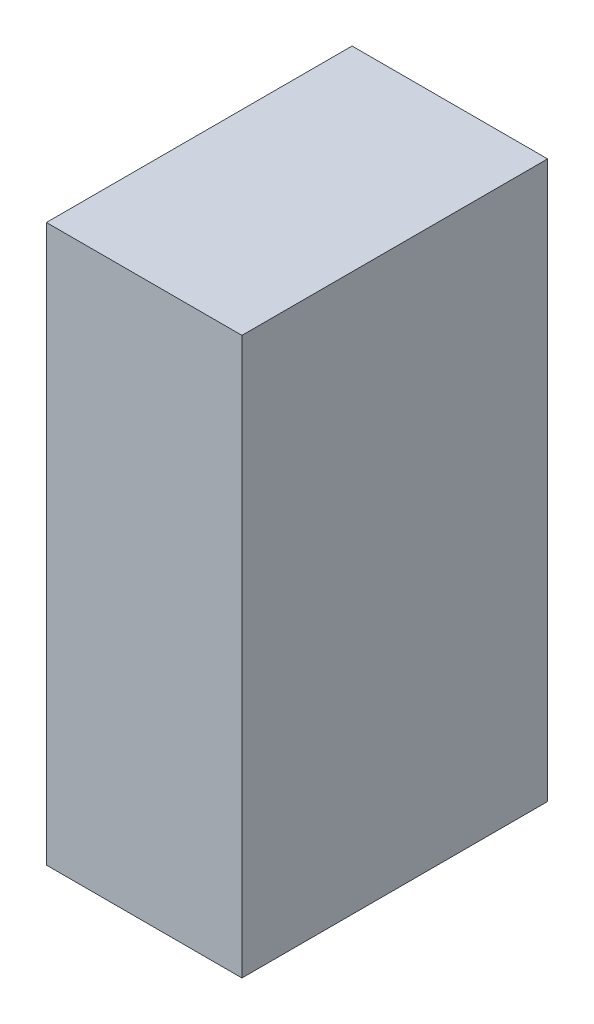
ISO-10303-21;
HEADER;
FILE_DESCRIPTION(('STEP AP214'),'2;1');
FILE_NAME('part.step','',(''),(''),'','','');
FILE_SCHEMA(('AUTOMOTIVE_DESIGN { 1 0 10303 214 1 1 1 1 }'));
ENDSEC;
DATA;
#1=APPLICATION_CONTEXT('core data for automotive mechanical design processes');
#2=APPLICATION_PROTOCOL_DEFINITION('international standard','automotive_design',2000,#1);
#3=PRODUCT_CONTEXT('',#1,'mechanical');
#4=PRODUCT('Part','Part','',(#3));
#5=PRODUCT_RELATED_PRODUCT_CATEGORY('part','',(#4));
#6=PRODUCT_DEFINITION_FORMATION('','',#4);
#7=PRODUCT_DEFINITION_CONTEXT('part definition',#1,'design');
#8=PRODUCT_DEFINITION('design','',#6,#7);
#9=PRODUCT_DEFINITION_SHAPE('','',#8);
#10=(LENGTH_UNIT() NAMED_UNIT(*) SI_UNIT(.MILLI.,.METRE.));
#11=(NAMED_UNIT(*) PLANE_ANGLE_UNIT() SI_UNIT($,.RADIAN.));
#12=(NAMED_UNIT(*) SI_UNIT($,.STERADIAN.) SOLID_ANGLE_UNIT());
#13=UNCERTAINTY_MEASURE_WITH_UNIT(LENGTH_MEASURE(1.E-05),#10,'distance_accuracy_value','');
#14=(GEOMETRIC_REPRESENTATION_CONTEXT(3) GLOBAL_UNCERTAINTY_ASSIGNED_CONTEXT((#13)) GLOBAL_UNIT_ASSIGNED_CONTEXT((#10,
#11,#12)) REPRESENTATION_CONTEXT('',''));
#15=CARTESIAN_POINT('',(0.,0.,0.));
#16=DIRECTION('',(0.,0.,1.));
#17=DIRECTION('',(1.,0.,0.));
#18=AXIS2_PLACEMENT_3D('',#15,#16,#17);
#19=CARTESIAN_POINT('',(0.32500062,0.92499942,0.));
#20=DIRECTION('',(1.,0.,0.));
#21=DIRECTION('',(0.,0.,-1.));
#22=AXIS2_PLACEMENT_3D('',#19,#20,#21);
#23=PLANE('',#22);
#24=DIRECTION('',(0.,0.,-1.));
#25=VECTOR('',#24,1.);
#26=CARTESIAN_POINT('',(0.32500062,-0.92499942,0.));
#27=LINE('',#26,#25);
#28=CARTESIAN_POINT('',(0.32500062,-0.92499942,0.));
#29=VERTEX_POINT('',#28);
#30=CARTESIAN_POINT('',(0.32500062,-0.92499942,1.016));
#31=VERTEX_POINT('',#30);
#32=EDGE_CURVE('E20',#29,#31,#27,.F.);
#33=ORIENTED_EDGE('',*,*,#32,.F.);
#34=DIRECTION('',(0.,1.,0.));
#35=VECTOR('',#34,1.);
#36=CARTESIAN_POINT('',(0.32500062,-0.92499942,0.));
#37=LINE('',#36,#35);
#38=CARTESIAN_POINT('',(0.32500062,0.92499942,0.));
#39=VERTEX_POINT('',#38);
#40=EDGE_CURVE('E79',#29,#39,#37,.T.);
#41=ORIENTED_EDGE('',*,*,#40,.T.);
#42=DIRECTION('',(0.,0.,1.));
#43=VECTOR('',#42,1.);
#44=CARTESIAN_POINT('',(0.32500062,0.92499942,0.));
#45=LINE('',#44,#43);
#46=CARTESIAN_POINT('',(0.32500062,0.92499942,1.016));
#47=VERTEX_POINT('',#46);
#48=EDGE_CURVE('E61',#47,#39,#45,.F.);
#49=ORIENTED_EDGE('',*,*,#48,.F.);
#50=DIRECTION('',(0.,1.,0.));
#51=VECTOR('',#50,1.);
#52=CARTESIAN_POINT('',(0.32500062,-0.92499942,1.016));
#53=LINE('',#52,#51);
#54=EDGE_CURVE('E56',#31,#47,#53,.T.);
#55=ORIENTED_EDGE('',*,*,#54,.F.);
#56=EDGE_LOOP('',(#33,#41,#49,#55));
#57=FACE_BOUND('',#56,.T.);
#58=ADVANCED_FACE('F17',(#57),#23,.T.);
#59=CARTESIAN_POINT('',(0.32500062,-0.92499942,0.));
#60=DIRECTION('',(0.,-1.,0.));
#61=DIRECTION('',(0.,0.,-1.));
#62=AXIS2_PLACEMENT_3D('',#59,#60,#61);
#63=PLANE('',#62);
#64=DIRECTION('',(0.,0.,1.));
#65=VECTOR('',#64,1.);
#66=CARTESIAN_POINT('',(-0.32500062,-0.92499942,0.));
#67=LINE('',#66,#65);
#68=CARTESIAN_POINT('',(-0.32500062,-0.92499942,0.));
#69=VERTEX_POINT('',#68);
#70=CARTESIAN_POINT('',(-0.32500062,-0.92499942,1.016));
#71=VERTEX_POINT('',#70);
#72=EDGE_CURVE('E83',#69,#71,#67,.T.);
#73=ORIENTED_EDGE('',*,*,#72,.F.);
#74=DIRECTION('',(1.,0.,0.));
#75=VECTOR('',#74,1.);
#76=CARTESIAN_POINT('',(0.32500062,-0.92499942,0.));
#77=LINE('',#76,#75);
#78=EDGE_CURVE('E68',#69,#29,#77,.T.);
#79=ORIENTED_EDGE('',*,*,#78,.T.);
#80=ORIENTED_EDGE('',*,*,#32,.T.);
#81=DIRECTION('',(1.,0.,0.));
#82=VECTOR('',#81,1.);
#83=CARTESIAN_POINT('',(0.32500062,-0.92499942,1.016));
#84=LINE('',#83,#82);
#85=EDGE_CURVE('E63',#71,#31,#84,.T.);
#86=ORIENTED_EDGE('',*,*,#85,.F.);
#87=EDGE_LOOP('',(#73,#79,#80,#86));
#88=FACE_BOUND('',#87,.T.);
#89=ADVANCED_FACE('F65',(#88),#63,.T.);
#90=CARTESIAN_POINT('',(0.32500062,-0.92499942,1.016));
#91=DIRECTION('',(0.,0.,1.));
#92=DIRECTION('',(1.,0.,0.));
#93=AXIS2_PLACEMENT_3D('',#90,#91,#92);
#94=PLANE('',#93);
#95=DIRECTION('',(0.,1.,0.));
#96=VECTOR('',#95,1.);
#97=CARTESIAN_POINT('',(-0.32500062,-0.92499942,1.016));
#98=LINE('',#97,#96);
#99=CARTESIAN_POINT('',(-0.32500062,0.92499942,1.016));
#100=VERTEX_POINT('',#99);
#101=EDGE_CURVE('E72',#71,#100,#98,.T.);
#102=ORIENTED_EDGE('',*,*,#101,.F.);
#103=ORIENTED_EDGE('',*,*,#85,.T.);
#104=ORIENTED_EDGE('',*,*,#54,.T.);
#105=DIRECTION('',(1.,0.,0.));
#106=VECTOR('',#105,1.);
#107=CARTESIAN_POINT('',(-0.32500062,0.92499942,1.016));
#108=LINE('',#107,#106);
#109=EDGE_CURVE('E74',#100,#47,#108,.T.);
#110=ORIENTED_EDGE('',*,*,#109,.F.);
#111=EDGE_LOOP('',(#102,#103,#104,#110));
#112=FACE_BOUND('',#111,.T.);
#113=ADVANCED_FACE('F70',(#112),#94,.T.);
#114=CARTESIAN_POINT('',(-0.32500062,0.92499942,0.));
#115=DIRECTION('',(0.,1.,0.));
#116=DIRECTION('',(0.,0.,1.));
#117=AXIS2_PLACEMENT_3D('',#114,#115,#116);
#118=PLANE('',#117);
#119=ORIENTED_EDGE('',*,*,#48,.T.);
#120=DIRECTION('',(1.,0.,0.));
#121=VECTOR('',#120,1.);
#122=CARTESIAN_POINT('',(0.32500062,0.92499942,0.));
#123=LINE('',#122,#121);
#124=CARTESIAN_POINT('',(-0.32500062,0.92499942,0.));
#125=VERTEX_POINT('',#124);
#126=EDGE_CURVE('E35',#39,#125,#123,.F.);
#127=ORIENTED_EDGE('',*,*,#126,.T.);
#128=DIRECTION('',(0.,0.,1.));
#129=VECTOR('',#128,1.);
#130=CARTESIAN_POINT('',(-0.32500062,0.92499942,0.));
#131=LINE('',#130,#129);
#132=EDGE_CURVE('E26',#100,#125,#131,.F.);
#133=ORIENTED_EDGE('',*,*,#132,.F.);
#134=ORIENTED_EDGE('',*,*,#109,.T.);
#135=EDGE_LOOP('',(#119,#127,#133,#134));
#136=FACE_BOUND('',#135,.T.);
#137=ADVANCED_FACE('F89',(#136),#118,.T.);
#138=CARTESIAN_POINT('',(0.32500062,-0.92499942,0.));
#139=DIRECTION('',(0.,0.,1.));
#140=DIRECTION('',(1.,0.,0.));
#141=AXIS2_PLACEMENT_3D('',#138,#139,#140);
#142=PLANE('',#141);
#143=DIRECTION('',(0.,1.,0.));
#144=VECTOR('',#143,1.);
#145=CARTESIAN_POINT('',(-0.32500062,-0.92499942,0.));
#146=LINE('',#145,#144);
#147=EDGE_CURVE('E11',#125,#69,#146,.F.);
#148=ORIENTED_EDGE('',*,*,#147,.F.);
#149=ORIENTED_EDGE('',*,*,#126,.F.);
#150=ORIENTED_EDGE('',*,*,#40,.F.);
#151=ORIENTED_EDGE('',*,*,#78,.F.);
#152=EDGE_LOOP('',(#148,#149,#150,#151));
#153=FACE_BOUND('',#152,.T.);
#154=ADVANCED_FACE('F91',(#153),#142,.F.);
#155=CARTESIAN_POINT('',(-0.32500062,-0.92499942,0.));
#156=DIRECTION('',(-1.,0.,0.));
#157=DIRECTION('',(0.,0.,1.));
#158=AXIS2_PLACEMENT_3D('',#155,#156,#157);
#159=PLANE('',#158);
#160=ORIENTED_EDGE('',*,*,#132,.T.);
#161=ORIENTED_EDGE('',*,*,#147,.T.);
#162=ORIENTED_EDGE('',*,*,#72,.T.);
#163=ORIENTED_EDGE('',*,*,#101,.T.);
#164=EDGE_LOOP('',(#160,#161,#162,#163));
#165=FACE_BOUND('',#164,.T.);
#166=ADVANCED_FACE('F88',(#165),#159,.T.);
#167=CLOSED_SHELL('',(#58,#89,#113,#137,#154,#166));
#168=MANIFOLD_SOLID_BREP('B1',#167);
#169=ADVANCED_BREP_SHAPE_REPRESENTATION('',(#18,#168),#14);
#170=SHAPE_DEFINITION_REPRESENTATION(#9,#169);
ENDSEC;
END-ISO-10303-21;
